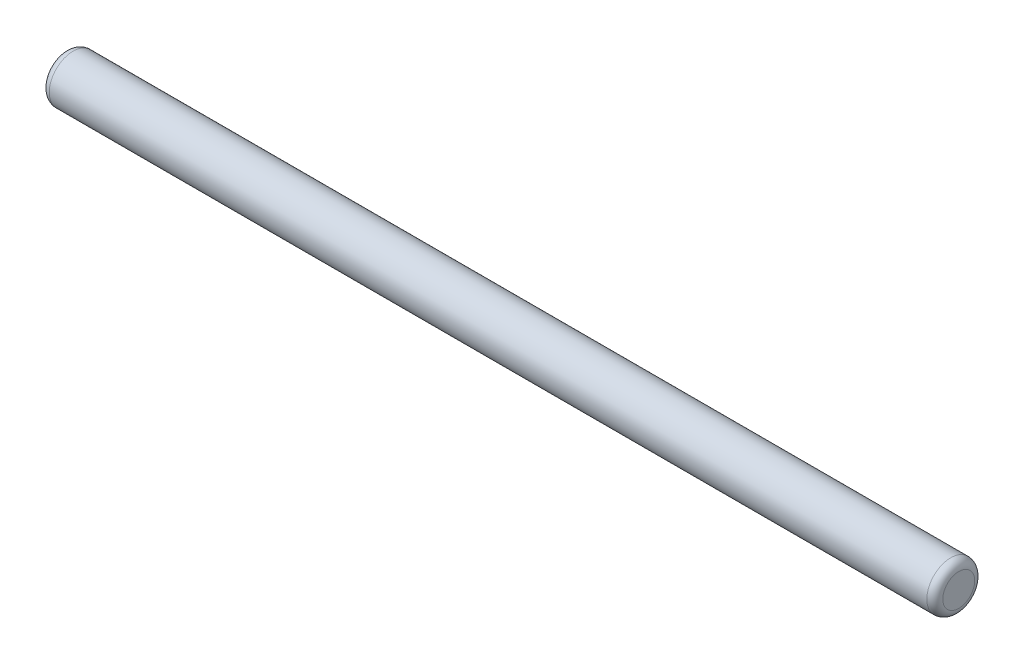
ISO-10303-21;
HEADER;
FILE_DESCRIPTION(('STEP AP214'),'2;1');
FILE_NAME('part.step','',(''),(''),'','','');
FILE_SCHEMA(('AUTOMOTIVE_DESIGN { 1 0 10303 214 1 1 1 1 }'));
ENDSEC;
DATA;
#1=APPLICATION_CONTEXT('core data for automotive mechanical design processes');
#2=APPLICATION_PROTOCOL_DEFINITION('international standard','automotive_design',2000,#1);
#3=PRODUCT_CONTEXT('',#1,'mechanical');
#4=PRODUCT('Part','Part','',(#3));
#5=PRODUCT_RELATED_PRODUCT_CATEGORY('part','',(#4));
#6=PRODUCT_DEFINITION_FORMATION('','',#4);
#7=PRODUCT_DEFINITION_CONTEXT('part definition',#1,'design');
#8=PRODUCT_DEFINITION('design','',#6,#7);
#9=PRODUCT_DEFINITION_SHAPE('','',#8);
#10=(LENGTH_UNIT() NAMED_UNIT(*) SI_UNIT(.MILLI.,.METRE.));
#11=(NAMED_UNIT(*) PLANE_ANGLE_UNIT() SI_UNIT($,.RADIAN.));
#12=(NAMED_UNIT(*) SI_UNIT($,.STERADIAN.) SOLID_ANGLE_UNIT());
#13=UNCERTAINTY_MEASURE_WITH_UNIT(LENGTH_MEASURE(1.E-05),#10,'distance_accuracy_value','');
#14=(GEOMETRIC_REPRESENTATION_CONTEXT(3) GLOBAL_UNCERTAINTY_ASSIGNED_CONTEXT((#13)) GLOBAL_UNIT_ASSIGNED_CONTEXT((#10,
#11,#12)) REPRESENTATION_CONTEXT('',''));
#15=CARTESIAN_POINT('',(0.,0.,0.));
#16=DIRECTION('',(0.,0.,1.));
#17=DIRECTION('',(1.,0.,0.));
#18=AXIS2_PLACEMENT_3D('',#15,#16,#17);
#19=CARTESIAN_POINT('',(177.8,0.,0.));
#20=DIRECTION('',(-1.,0.,0.));
#21=DIRECTION('',(0.,0.,1.));
#22=AXIS2_PLACEMENT_3D('',#19,#20,#21);
#23=CYLINDRICAL_SURFACE('',#22,4.7625);
#24=CARTESIAN_POINT('',(1.58749999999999,0.,0.));
#25=DIRECTION('',(1.,0.,0.));
#26=DIRECTION('',(0.,0.,-1.));
#27=AXIS2_PLACEMENT_3D('',#24,#25,#26);
#28=CIRCLE('',#27,4.7625);
#29=CARTESIAN_POINT('',(1.58749999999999,0.,-4.7625));
#30=VERTEX_POINT('',#29);
#31=EDGE_CURVE('E42',#30,#30,#28,.T.);
#32=ORIENTED_EDGE('',*,*,#31,.T.);
#33=EDGE_LOOP('',(#32));
#34=FACE_BOUND('',#33,.T.);
#35=CARTESIAN_POINT('',(176.2125,0.,0.));
#36=DIRECTION('',(1.,0.,0.));
#37=DIRECTION('',(0.,0.,-1.));
#38=AXIS2_PLACEMENT_3D('',#35,#36,#37);
#39=CIRCLE('',#38,4.7625);
#40=CARTESIAN_POINT('',(176.2125,0.,-4.7625));
#41=VERTEX_POINT('',#40);
#42=EDGE_CURVE('E46',#41,#41,#39,.F.);
#43=ORIENTED_EDGE('',*,*,#42,.T.);
#44=EDGE_LOOP('',(#43));
#45=FACE_BOUND('',#44,.T.);
#46=ADVANCED_FACE('F31',(#34,#45),#23,.T.);
#47=CARTESIAN_POINT('',(177.8,0.,0.));
#48=DIRECTION('',(1.,0.,0.));
#49=DIRECTION('',(0.,0.,-1.));
#50=AXIS2_PLACEMENT_3D('',#47,#48,#49);
#51=PLANE('',#50);
#52=CARTESIAN_POINT('',(177.8,0.,0.));
#53=DIRECTION('',(1.,0.,0.));
#54=DIRECTION('',(0.,0.,-1.));
#55=AXIS2_PLACEMENT_3D('',#52,#53,#54);
#56=CIRCLE('',#55,3.175);
#57=CARTESIAN_POINT('',(177.8,0.,-3.175));
#58=VERTEX_POINT('',#57);
#59=EDGE_CURVE('E10',#58,#58,#56,.T.);
#60=ORIENTED_EDGE('',*,*,#59,.T.);
#61=EDGE_LOOP('',(#60));
#62=FACE_BOUND('',#61,.T.);
#63=ADVANCED_FACE('F62',(#62),#51,.T.);
#64=CARTESIAN_POINT('',(0.,0.,0.));
#65=DIRECTION('',(1.,0.,0.));
#66=DIRECTION('',(0.,0.,-1.));
#67=AXIS2_PLACEMENT_3D('',#64,#65,#66);
#68=PLANE('',#67);
#69=CARTESIAN_POINT('',(0.,0.,0.));
#70=DIRECTION('',(1.,0.,0.));
#71=DIRECTION('',(0.,0.,-1.));
#72=AXIS2_PLACEMENT_3D('',#69,#70,#71);
#73=CIRCLE('',#72,3.175);
#74=CARTESIAN_POINT('',(0.,0.,-3.175));
#75=VERTEX_POINT('',#74);
#76=EDGE_CURVE('E38',#75,#75,#73,.F.);
#77=ORIENTED_EDGE('',*,*,#76,.T.);
#78=EDGE_LOOP('',(#77));
#79=FACE_BOUND('',#78,.T.);
#80=ADVANCED_FACE('F59',(#79),#68,.F.);
#81=CARTESIAN_POINT('',(1.58749999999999,0.,0.));
#82=DIRECTION('',(1.,0.,0.));
#83=DIRECTION('',(0.,0.,-1.));
#84=AXIS2_PLACEMENT_3D('',#81,#82,#83);
#85=TOROIDAL_SURFACE('',#84,3.175,1.5875);
#86=ORIENTED_EDGE('',*,*,#76,.F.);
#87=EDGE_LOOP('',(#86));
#88=FACE_BOUND('',#87,.T.);
#89=ORIENTED_EDGE('',*,*,#31,.F.);
#90=EDGE_LOOP('',(#89));
#91=FACE_BOUND('',#90,.T.);
#92=ADVANCED_FACE('F55',(#88,#91),#85,.T.);
#93=CARTESIAN_POINT('',(176.2125,0.,0.));
#94=DIRECTION('',(1.,0.,0.));
#95=DIRECTION('',(0.,0.,-1.));
#96=AXIS2_PLACEMENT_3D('',#93,#94,#95);
#97=TOROIDAL_SURFACE('',#96,3.175,1.5875);
#98=ORIENTED_EDGE('',*,*,#42,.F.);
#99=EDGE_LOOP('',(#98));
#100=FACE_BOUND('',#99,.T.);
#101=ORIENTED_EDGE('',*,*,#59,.F.);
#102=EDGE_LOOP('',(#101));
#103=FACE_BOUND('',#102,.T.);
#104=ADVANCED_FACE('F33',(#100,#103),#97,.T.);
#105=CLOSED_SHELL('',(#46,#63,#80,#92,#104));
#106=MANIFOLD_SOLID_BREP('B2',#105);
#107=ADVANCED_BREP_SHAPE_REPRESENTATION('',(#18,#106),#14);
#108=SHAPE_DEFINITION_REPRESENTATION(#9,#107);
ENDSEC;
END-ISO-10303-21;
